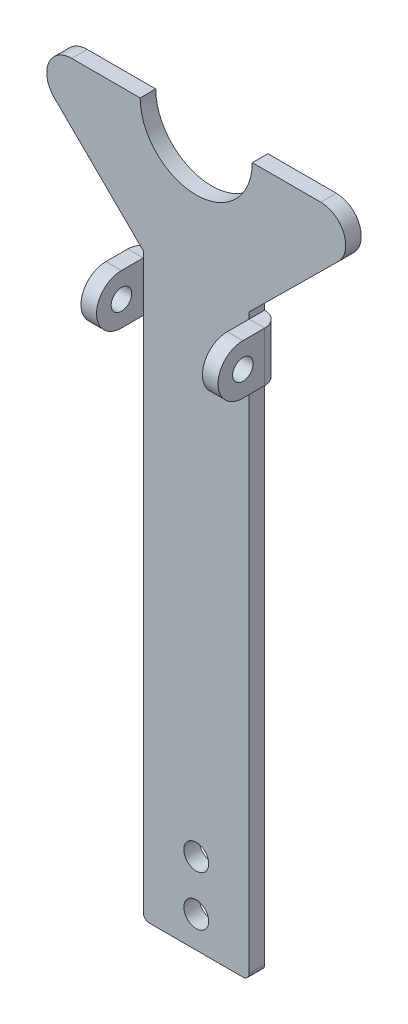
ISO-10303-21;
HEADER;
FILE_DESCRIPTION(('STEP AP214'),'2;1');
FILE_NAME('part.step','',(''),(''),'','','');
FILE_SCHEMA(('AUTOMOTIVE_DESIGN { 1 0 10303 214 1 1 1 1 }'));
ENDSEC;
DATA;
#1=APPLICATION_CONTEXT('core data for automotive mechanical design processes');
#2=APPLICATION_PROTOCOL_DEFINITION('international standard','automotive_design',2000,#1);
#3=PRODUCT_CONTEXT('',#1,'mechanical');
#4=PRODUCT('Part','Part','',(#3));
#5=PRODUCT_RELATED_PRODUCT_CATEGORY('part','',(#4));
#6=PRODUCT_DEFINITION_FORMATION('','',#4);
#7=PRODUCT_DEFINITION_CONTEXT('part definition',#1,'design');
#8=PRODUCT_DEFINITION('design','',#6,#7);
#9=PRODUCT_DEFINITION_SHAPE('','',#8);
#10=(LENGTH_UNIT() NAMED_UNIT(*) SI_UNIT(.MILLI.,.METRE.));
#11=(NAMED_UNIT(*) PLANE_ANGLE_UNIT() SI_UNIT($,.RADIAN.));
#12=(NAMED_UNIT(*) SI_UNIT($,.STERADIAN.) SOLID_ANGLE_UNIT());
#13=UNCERTAINTY_MEASURE_WITH_UNIT(LENGTH_MEASURE(1.E-05),#10,'distance_accuracy_value','');
#14=(GEOMETRIC_REPRESENTATION_CONTEXT(3) GLOBAL_UNCERTAINTY_ASSIGNED_CONTEXT((#13)) GLOBAL_UNIT_ASSIGNED_CONTEXT((#10,
#11,#12)) REPRESENTATION_CONTEXT('',''));
#15=CARTESIAN_POINT('',(0.,0.,0.));
#16=DIRECTION('',(0.,0.,1.));
#17=DIRECTION('',(1.,0.,0.));
#18=AXIS2_PLACEMENT_3D('',#15,#16,#17);
#19=CARTESIAN_POINT('',(8.5,0.,2.5));
#20=DIRECTION('',(-1.,0.,0.));
#21=DIRECTION('',(0.,0.,1.));
#22=AXIS2_PLACEMENT_3D('',#19,#20,#21);
#23=PLANE('',#22);
#24=DIRECTION('',(0.,0.,1.));
#25=VECTOR('',#24,1.);
#26=CARTESIAN_POINT('',(8.49999999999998,91.9999999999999,0.));
#27=LINE('',#26,#25);
#28=CARTESIAN_POINT('',(8.49999999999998,91.9999999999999,0.));
#29=VERTEX_POINT('',#28);
#30=CARTESIAN_POINT('',(8.49999999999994,91.9999999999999,2.5));
#31=VERTEX_POINT('',#30);
#32=EDGE_CURVE('E368',#29,#31,#27,.T.);
#33=ORIENTED_EDGE('',*,*,#32,.F.);
#34=DIRECTION('',(0.,1.,0.));
#35=VECTOR('',#34,1.);
#36=CARTESIAN_POINT('',(8.5,0.,0.));
#37=LINE('',#36,#35);
#38=CARTESIAN_POINT('',(8.5,93.,0.));
#39=VERTEX_POINT('',#38);
#40=EDGE_CURVE('E313',#29,#39,#37,.T.);
#41=ORIENTED_EDGE('',*,*,#40,.T.);
#42=DIRECTION('',(0.,0.,-1.));
#43=VECTOR('',#42,1.);
#44=CARTESIAN_POINT('',(8.5,93.,2.5));
#45=LINE('',#44,#43);
#46=CARTESIAN_POINT('',(8.5,93.,2.5));
#47=VERTEX_POINT('',#46);
#48=EDGE_CURVE('E591',#47,#39,#45,.T.);
#49=ORIENTED_EDGE('',*,*,#48,.F.);
#50=DIRECTION('',(0.,1.,0.));
#51=VECTOR('',#50,1.);
#52=CARTESIAN_POINT('',(8.5,0.,2.5));
#53=LINE('',#52,#51);
#54=EDGE_CURVE('E329',#31,#47,#53,.T.);
#55=ORIENTED_EDGE('',*,*,#54,.F.);
#56=EDGE_LOOP('',(#33,#41,#49,#55));
#57=FACE_BOUND('',#56,.T.);
#58=ADVANCED_FACE('F41',(#57),#23,.F.);
#59=CARTESIAN_POINT('',(-8.5,0.,2.5));
#60=DIRECTION('',(1.,0.,0.));
#61=DIRECTION('',(0.,0.,-1.));
#62=AXIS2_PLACEMENT_3D('',#59,#60,#61);
#63=PLANE('',#62);
#64=DIRECTION('',(0.,-1.,0.));
#65=VECTOR('',#64,1.);
#66=CARTESIAN_POINT('',(-8.5,0.,0.));
#67=LINE('',#66,#65);
#68=CARTESIAN_POINT('',(-8.49999999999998,84.,0.));
#69=VERTEX_POINT('',#68);
#70=CARTESIAN_POINT('',(-8.5,0.999999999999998,0.));
#71=VERTEX_POINT('',#70);
#72=EDGE_CURVE('E300',#69,#71,#67,.T.);
#73=ORIENTED_EDGE('',*,*,#72,.T.);
#74=DIRECTION('',(0.,0.,-1.));
#75=VECTOR('',#74,1.);
#76=CARTESIAN_POINT('',(-8.5,0.999999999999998,2.5));
#77=LINE('',#76,#75);
#78=CARTESIAN_POINT('',(-8.5,0.999999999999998,2.5));
#79=VERTEX_POINT('',#78);
#80=EDGE_CURVE('E11',#71,#79,#77,.F.);
#81=ORIENTED_EDGE('',*,*,#80,.T.);
#82=DIRECTION('',(0.,-1.,0.));
#83=VECTOR('',#82,1.);
#84=CARTESIAN_POINT('',(-8.5,0.,2.5));
#85=LINE('',#84,#83);
#86=CARTESIAN_POINT('',(-8.5,84.,2.5));
#87=VERTEX_POINT('',#86);
#88=EDGE_CURVE('E288',#87,#79,#85,.T.);
#89=ORIENTED_EDGE('',*,*,#88,.F.);
#90=DIRECTION('',(0.,0.,1.));
#91=VECTOR('',#90,1.);
#92=CARTESIAN_POINT('',(-8.49999999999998,84.,0.));
#93=LINE('',#92,#91);
#94=EDGE_CURVE('E347',#69,#87,#93,.T.);
#95=ORIENTED_EDGE('',*,*,#94,.F.);
#96=EDGE_LOOP('',(#73,#81,#89,#95));
#97=FACE_BOUND('',#96,.T.);
#98=ADVANCED_FACE('F435',(#97),#63,.F.);
#99=CARTESIAN_POINT('',(0.,114.,2.5));
#100=DIRECTION('',(0.,0.,-1.));
#101=DIRECTION('',(-1.,0.,0.));
#102=AXIS2_PLACEMENT_3D('',#99,#100,#101);
#103=CYLINDRICAL_SURFACE('',#102,9.);
#104=CARTESIAN_POINT('',(0.,114.,0.));
#105=DIRECTION('',(0.,0.,-1.));
#106=DIRECTION('',(1.,0.,0.));
#107=AXIS2_PLACEMENT_3D('',#104,#105,#106);
#108=CIRCLE('',#107,9.);
#109=CARTESIAN_POINT('',(9.,114.,0.));
#110=VERTEX_POINT('',#109);
#111=CARTESIAN_POINT('',(-9.,114.,0.));
#112=VERTEX_POINT('',#111);
#113=EDGE_CURVE('E277',#110,#112,#108,.T.);
#114=ORIENTED_EDGE('',*,*,#113,.T.);
#115=DIRECTION('',(0.,0.,-1.));
#116=VECTOR('',#115,1.);
#117=CARTESIAN_POINT('',(-9.,114.,2.5));
#118=LINE('',#117,#116);
#119=CARTESIAN_POINT('',(-9.,114.,2.5));
#120=VERTEX_POINT('',#119);
#121=EDGE_CURVE('E341',#120,#112,#118,.T.);
#122=ORIENTED_EDGE('',*,*,#121,.F.);
#123=CARTESIAN_POINT('',(0.,114.,2.5));
#124=DIRECTION('',(0.,0.,-1.));
#125=DIRECTION('',(1.,0.,0.));
#126=AXIS2_PLACEMENT_3D('',#123,#124,#125);
#127=CIRCLE('',#126,9.);
#128=CARTESIAN_POINT('',(9.,114.,2.5));
#129=VERTEX_POINT('',#128);
#130=EDGE_CURVE('E278',#129,#120,#127,.T.);
#131=ORIENTED_EDGE('',*,*,#130,.F.);
#132=DIRECTION('',(0.,0.,-1.));
#133=VECTOR('',#132,1.);
#134=CARTESIAN_POINT('',(9.,114.,2.5));
#135=LINE('',#134,#133);
#136=EDGE_CURVE('E583',#129,#110,#135,.T.);
#137=ORIENTED_EDGE('',*,*,#136,.T.);
#138=EDGE_LOOP('',(#114,#122,#131,#137));
#139=FACE_BOUND('',#138,.T.);
#140=ADVANCED_FACE('F441',(#139),#103,.F.);
#141=CARTESIAN_POINT('',(-20.,114.,2.5));
#142=DIRECTION('',(0.,-1.,0.));
#143=DIRECTION('',(0.,0.,-1.));
#144=AXIS2_PLACEMENT_3D('',#141,#142,#143);
#145=PLANE('',#144);
#146=DIRECTION('',(-1.,0.,0.));
#147=VECTOR('',#146,1.);
#148=CARTESIAN_POINT('',(-20.,114.,0.));
#149=LINE('',#148,#147);
#150=CARTESIAN_POINT('',(-20.,114.,0.));
#151=VERTEX_POINT('',#150);
#152=EDGE_CURVE('E605',#112,#151,#149,.T.);
#153=ORIENTED_EDGE('',*,*,#152,.T.);
#154=DIRECTION('',(0.,0.,-1.));
#155=VECTOR('',#154,1.);
#156=CARTESIAN_POINT('',(-20.,114.,2.5));
#157=LINE('',#156,#155);
#158=CARTESIAN_POINT('',(-20.,114.,2.5));
#159=VERTEX_POINT('',#158);
#160=EDGE_CURVE('E600',#159,#151,#157,.T.);
#161=ORIENTED_EDGE('',*,*,#160,.F.);
#162=DIRECTION('',(-1.,0.,0.));
#163=VECTOR('',#162,1.);
#164=CARTESIAN_POINT('',(-20.,114.,2.5));
#165=LINE('',#164,#163);
#166=EDGE_CURVE('E281',#120,#159,#165,.T.);
#167=ORIENTED_EDGE('',*,*,#166,.F.);
#168=ORIENTED_EDGE('',*,*,#121,.T.);
#169=EDGE_LOOP('',(#153,#161,#167,#168));
#170=FACE_BOUND('',#169,.T.);
#171=ADVANCED_FACE('F468',(#170),#145,.F.);
#172=CARTESIAN_POINT('',(-20.,110.,2.5));
#173=DIRECTION('',(0.,0.,-1.));
#174=DIRECTION('',(-1.,0.,0.));
#175=AXIS2_PLACEMENT_3D('',#172,#173,#174);
#176=CYLINDRICAL_SURFACE('',#175,3.99999999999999);
#177=CARTESIAN_POINT('',(-20.,110.,0.));
#178=DIRECTION('',(0.,0.,1.));
#179=DIRECTION('',(-1.,0.,0.));
#180=AXIS2_PLACEMENT_3D('',#177,#178,#179);
#181=CIRCLE('',#180,3.99999999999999);
#182=CARTESIAN_POINT('',(-22.8128092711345,107.156040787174,0.));
#183=VERTEX_POINT('',#182);
#184=EDGE_CURVE('E608',#151,#183,#181,.T.);
#185=ORIENTED_EDGE('',*,*,#184,.T.);
#186=DIRECTION('',(0.,0.,-1.));
#187=VECTOR('',#186,1.);
#188=CARTESIAN_POINT('',(-22.8128092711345,107.156040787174,2.5));
#189=LINE('',#188,#187);
#190=CARTESIAN_POINT('',(-22.8128092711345,107.156040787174,2.5));
#191=VERTEX_POINT('',#190);
#192=EDGE_CURVE('E597',#191,#183,#189,.T.);
#193=ORIENTED_EDGE('',*,*,#192,.F.);
#194=CARTESIAN_POINT('',(-20.,110.,2.5));
#195=DIRECTION('',(0.,0.,1.));
#196=DIRECTION('',(-1.,0.,0.));
#197=AXIS2_PLACEMENT_3D('',#194,#195,#196);
#198=CIRCLE('',#197,3.99999999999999);
#199=EDGE_CURVE('E284',#159,#191,#198,.T.);
#200=ORIENTED_EDGE('',*,*,#199,.F.);
#201=ORIENTED_EDGE('',*,*,#160,.T.);
#202=EDGE_LOOP('',(#185,#193,#200,#201));
#203=FACE_BOUND('',#202,.T.);
#204=ADVANCED_FACE('F464',(#203),#176,.T.);
#205=CARTESIAN_POINT('',(-8.5,93.,2.5));
#206=DIRECTION('',(0.703202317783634,0.710989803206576,0.));
#207=DIRECTION('',(-0.710989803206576,0.703202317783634,0.));
#208=AXIS2_PLACEMENT_3D('',#205,#206,#207);
#209=PLANE('',#208);
#210=DIRECTION('',(0.710989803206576,-0.703202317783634,0.));
#211=VECTOR('',#210,1.);
#212=CARTESIAN_POINT('',(-8.5,93.,0.));
#213=LINE('',#212,#211);
#214=CARTESIAN_POINT('',(-8.5,93.,0.));
#215=VERTEX_POINT('',#214);
#216=EDGE_CURVE('E304',#183,#215,#213,.T.);
#217=ORIENTED_EDGE('',*,*,#216,.T.);
#218=DIRECTION('',(0.,0.,-1.));
#219=VECTOR('',#218,1.);
#220=CARTESIAN_POINT('',(-8.5,93.,2.5));
#221=LINE('',#220,#219);
#222=CARTESIAN_POINT('',(-8.5,93.,2.5));
#223=VERTEX_POINT('',#222);
#224=EDGE_CURVE('E594',#223,#215,#221,.T.);
#225=ORIENTED_EDGE('',*,*,#224,.F.);
#226=DIRECTION('',(0.710989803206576,-0.703202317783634,0.));
#227=VECTOR('',#226,1.);
#228=CARTESIAN_POINT('',(-8.5,93.,2.5));
#229=LINE('',#228,#227);
#230=EDGE_CURVE('E286',#191,#223,#229,.T.);
#231=ORIENTED_EDGE('',*,*,#230,.F.);
#232=ORIENTED_EDGE('',*,*,#192,.T.);
#233=EDGE_LOOP('',(#217,#225,#231,#232));
#234=FACE_BOUND('',#233,.T.);
#235=ADVANCED_FACE('F459',(#234),#209,.F.);
#236=CARTESIAN_POINT('',(-8.49999999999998,92.,0.));
#237=VERTEX_POINT('',#236);
#238=EDGE_CURVE('E303',#215,#237,#67,.T.);
#239=ORIENTED_EDGE('',*,*,#238,.T.);
#240=DIRECTION('',(0.,0.,1.));
#241=VECTOR('',#240,1.);
#242=CARTESIAN_POINT('',(-8.49999999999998,92.,0.));
#243=LINE('',#242,#241);
#244=CARTESIAN_POINT('',(-8.5,92.,2.5));
#245=VERTEX_POINT('',#244);
#246=EDGE_CURVE('E340',#237,#245,#243,.T.);
#247=ORIENTED_EDGE('',*,*,#246,.T.);
#248=EDGE_CURVE('E297',#223,#245,#85,.T.);
#249=ORIENTED_EDGE('',*,*,#248,.F.);
#250=ORIENTED_EDGE('',*,*,#224,.T.);
#251=EDGE_LOOP('',(#239,#247,#249,#250));
#252=FACE_BOUND('',#251,.T.);
#253=ADVANCED_FACE('F443',(#252),#63,.F.);
#254=CARTESIAN_POINT('',(8.5,0.,2.5));
#255=DIRECTION('',(0.,1.,0.));
#256=DIRECTION('',(0.,0.,1.));
#257=AXIS2_PLACEMENT_3D('',#254,#255,#256);
#258=PLANE('',#257);
#259=DIRECTION('',(1.,0.,0.));
#260=VECTOR('',#259,1.);
#261=CARTESIAN_POINT('',(8.5,0.,0.));
#262=LINE('',#261,#260);
#263=CARTESIAN_POINT('',(-7.5,0.,0.));
#264=VERTEX_POINT('',#263);
#265=CARTESIAN_POINT('',(7.5,0.,0.));
#266=VERTEX_POINT('',#265);
#267=EDGE_CURVE('E310',#264,#266,#262,.T.);
#268=ORIENTED_EDGE('',*,*,#267,.T.);
#269=DIRECTION('',(0.,0.,-1.));
#270=VECTOR('',#269,1.);
#271=CARTESIAN_POINT('',(7.5,0.,2.5));
#272=LINE('',#271,#270);
#273=CARTESIAN_POINT('',(7.5,0.,2.5));
#274=VERTEX_POINT('',#273);
#275=EDGE_CURVE('E64',#266,#274,#272,.F.);
#276=ORIENTED_EDGE('',*,*,#275,.T.);
#277=DIRECTION('',(1.,0.,0.));
#278=VECTOR('',#277,1.);
#279=CARTESIAN_POINT('',(8.5,0.,2.5));
#280=LINE('',#279,#278);
#281=CARTESIAN_POINT('',(-7.5,0.,2.5));
#282=VERTEX_POINT('',#281);
#283=EDGE_CURVE('E291',#282,#274,#280,.T.);
#284=ORIENTED_EDGE('',*,*,#283,.F.);
#285=DIRECTION('',(0.,0.,-1.));
#286=VECTOR('',#285,1.);
#287=CARTESIAN_POINT('',(-7.5,0.,2.5));
#288=LINE('',#287,#286);
#289=EDGE_CURVE('E643',#282,#264,#288,.T.);
#290=ORIENTED_EDGE('',*,*,#289,.T.);
#291=EDGE_LOOP('',(#268,#276,#284,#290));
#292=FACE_BOUND('',#291,.T.);
#293=ADVANCED_FACE('F449',(#292),#258,.F.);
#294=CARTESIAN_POINT('',(8.5,0.999999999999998,2.5));
#295=VERTEX_POINT('',#294);
#296=CARTESIAN_POINT('',(8.5,83.9999999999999,2.5));
#297=VERTEX_POINT('',#296);
#298=EDGE_CURVE('E326',#295,#297,#53,.T.);
#299=ORIENTED_EDGE('',*,*,#298,.F.);
#300=DIRECTION('',(0.,0.,-1.));
#301=VECTOR('',#300,1.);
#302=CARTESIAN_POINT('',(8.5,0.999999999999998,2.5));
#303=LINE('',#302,#301);
#304=CARTESIAN_POINT('',(8.5,0.999999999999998,0.));
#305=VERTEX_POINT('',#304);
#306=EDGE_CURVE('E330',#295,#305,#303,.T.);
#307=ORIENTED_EDGE('',*,*,#306,.T.);
#308=CARTESIAN_POINT('',(8.49999999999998,84.,0.));
#309=VERTEX_POINT('',#308);
#310=EDGE_CURVE('E321',#305,#309,#37,.T.);
#311=ORIENTED_EDGE('',*,*,#310,.T.);
#312=DIRECTION('',(0.,0.,1.));
#313=VECTOR('',#312,1.);
#314=CARTESIAN_POINT('',(8.49999999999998,84.,0.));
#315=LINE('',#314,#313);
#316=EDGE_CURVE('E362',#309,#297,#315,.T.);
#317=ORIENTED_EDGE('',*,*,#316,.T.);
#318=EDGE_LOOP('',(#299,#307,#311,#317));
#319=FACE_BOUND('',#318,.T.);
#320=ADVANCED_FACE('F379',(#319),#23,.F.);
#321=CARTESIAN_POINT('',(8.5,93.,2.5));
#322=DIRECTION('',(-0.703202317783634,0.710989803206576,0.));
#323=DIRECTION('',(-0.710989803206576,-0.703202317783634,0.));
#324=AXIS2_PLACEMENT_3D('',#321,#322,#323);
#325=PLANE('',#324);
#326=DIRECTION('',(0.710989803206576,0.703202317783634,0.));
#327=VECTOR('',#326,1.);
#328=CARTESIAN_POINT('',(8.5,93.,0.));
#329=LINE('',#328,#327);
#330=CARTESIAN_POINT('',(22.8128092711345,107.156040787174,0.));
#331=VERTEX_POINT('',#330);
#332=EDGE_CURVE('E316',#39,#331,#329,.T.);
#333=ORIENTED_EDGE('',*,*,#332,.T.);
#334=DIRECTION('',(0.,0.,-1.));
#335=VECTOR('',#334,1.);
#336=CARTESIAN_POINT('',(22.8128092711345,107.156040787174,2.5));
#337=LINE('',#336,#335);
#338=CARTESIAN_POINT('',(22.8128092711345,107.156040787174,2.5));
#339=VERTEX_POINT('',#338);
#340=EDGE_CURVE('E578',#339,#331,#337,.T.);
#341=ORIENTED_EDGE('',*,*,#340,.F.);
#342=DIRECTION('',(0.710989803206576,0.703202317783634,0.));
#343=VECTOR('',#342,1.);
#344=CARTESIAN_POINT('',(8.5,93.,2.5));
#345=LINE('',#344,#343);
#346=EDGE_CURVE('E328',#47,#339,#345,.T.);
#347=ORIENTED_EDGE('',*,*,#346,.F.);
#348=ORIENTED_EDGE('',*,*,#48,.T.);
#349=EDGE_LOOP('',(#333,#341,#347,#348));
#350=FACE_BOUND('',#349,.T.);
#351=ADVANCED_FACE('F448',(#350),#325,.F.);
#352=CARTESIAN_POINT('',(20.,110.,2.5));
#353=DIRECTION('',(0.,0.,-1.));
#354=DIRECTION('',(-1.,0.,0.));
#355=AXIS2_PLACEMENT_3D('',#352,#353,#354);
#356=CYLINDRICAL_SURFACE('',#355,3.99999999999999);
#357=CARTESIAN_POINT('',(20.,110.,0.));
#358=DIRECTION('',(0.,0.,1.));
#359=DIRECTION('',(1.,0.,0.));
#360=AXIS2_PLACEMENT_3D('',#357,#358,#359);
#361=CIRCLE('',#360,3.99999999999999);
#362=CARTESIAN_POINT('',(20.,114.,0.));
#363=VERTEX_POINT('',#362);
#364=EDGE_CURVE('E572',#331,#363,#361,.T.);
#365=ORIENTED_EDGE('',*,*,#364,.T.);
#366=DIRECTION('',(0.,0.,-1.));
#367=VECTOR('',#366,1.);
#368=CARTESIAN_POINT('',(20.,114.,2.5));
#369=LINE('',#368,#367);
#370=CARTESIAN_POINT('',(20.,114.,2.5));
#371=VERTEX_POINT('',#370);
#372=EDGE_CURVE('E575',#371,#363,#369,.T.);
#373=ORIENTED_EDGE('',*,*,#372,.F.);
#374=CARTESIAN_POINT('',(20.,110.,2.5));
#375=DIRECTION('',(0.,0.,1.));
#376=DIRECTION('',(1.,0.,0.));
#377=AXIS2_PLACEMENT_3D('',#374,#375,#376);
#378=CIRCLE('',#377,3.99999999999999);
#379=EDGE_CURVE('E631',#339,#371,#378,.T.);
#380=ORIENTED_EDGE('',*,*,#379,.F.);
#381=ORIENTED_EDGE('',*,*,#340,.T.);
#382=EDGE_LOOP('',(#365,#373,#380,#381));
#383=FACE_BOUND('',#382,.T.);
#384=ADVANCED_FACE('F454',(#383),#356,.T.);
#385=CARTESIAN_POINT('',(20.,114.,2.5));
#386=DIRECTION('',(0.,-1.,0.));
#387=DIRECTION('',(0.,0.,-1.));
#388=AXIS2_PLACEMENT_3D('',#385,#386,#387);
#389=PLANE('',#388);
#390=DIRECTION('',(-1.,0.,0.));
#391=VECTOR('',#390,1.);
#392=CARTESIAN_POINT('',(20.,114.,0.));
#393=LINE('',#392,#391);
#394=EDGE_CURVE('E282',#363,#110,#393,.T.);
#395=ORIENTED_EDGE('',*,*,#394,.T.);
#396=ORIENTED_EDGE('',*,*,#136,.F.);
#397=DIRECTION('',(-1.,0.,0.));
#398=VECTOR('',#397,1.);
#399=CARTESIAN_POINT('',(20.,114.,2.5));
#400=LINE('',#399,#398);
#401=EDGE_CURVE('E582',#371,#129,#400,.T.);
#402=ORIENTED_EDGE('',*,*,#401,.F.);
#403=ORIENTED_EDGE('',*,*,#372,.T.);
#404=EDGE_LOOP('',(#395,#396,#402,#403));
#405=FACE_BOUND('',#404,.T.);
#406=ADVANCED_FACE('F559',(#405),#389,.F.);
#407=CARTESIAN_POINT('',(0.,114.,2.5));
#408=DIRECTION('',(0.,0.,1.));
#409=DIRECTION('',(1.,0.,0.));
#410=AXIS2_PLACEMENT_3D('',#407,#408,#409);
#411=PLANE('',#410);
#412=CARTESIAN_POINT('',(0.,13.,2.5));
#413=DIRECTION('',(0.,0.,1.));
#414=DIRECTION('',(1.,0.,0.));
#415=AXIS2_PLACEMENT_3D('',#412,#413,#414);
#416=CIRCLE('',#415,2.);
#417=CARTESIAN_POINT('',(2.,13.,2.5));
#418=VERTEX_POINT('',#417);
#419=EDGE_CURVE('E415',#418,#418,#416,.T.);
#420=ORIENTED_EDGE('',*,*,#419,.F.);
#421=EDGE_LOOP('',(#420));
#422=FACE_BOUND('',#421,.T.);
#423=CARTESIAN_POINT('',(0.,5.,2.5));
#424=DIRECTION('',(0.,0.,1.));
#425=DIRECTION('',(1.,0.,0.));
#426=AXIS2_PLACEMENT_3D('',#423,#424,#425);
#427=CIRCLE('',#426,2.);
#428=CARTESIAN_POINT('',(2.,5.,2.5));
#429=VERTEX_POINT('',#428);
#430=EDGE_CURVE('E412',#429,#429,#427,.T.);
#431=ORIENTED_EDGE('',*,*,#430,.F.);
#432=EDGE_LOOP('',(#431));
#433=FACE_BOUND('',#432,.T.);
#434=ORIENTED_EDGE('',*,*,#283,.T.);
#435=CARTESIAN_POINT('',(7.5,0.999999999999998,2.5));
#436=DIRECTION('',(0.,0.,1.));
#437=DIRECTION('',(1.,0.,0.));
#438=AXIS2_PLACEMENT_3D('',#435,#436,#437);
#439=CIRCLE('',#438,1.);
#440=EDGE_CURVE('E50',#274,#295,#439,.T.);
#441=ORIENTED_EDGE('',*,*,#440,.T.);
#442=ORIENTED_EDGE('',*,*,#298,.T.);
#443=DIRECTION('',(0.,1.,0.));
#444=VECTOR('',#443,1.);
#445=CARTESIAN_POINT('',(8.5,84.,2.49999999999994));
#446=LINE('',#445,#444);
#447=EDGE_CURVE('E350',#297,#31,#446,.T.);
#448=ORIENTED_EDGE('',*,*,#447,.T.);
#449=ORIENTED_EDGE('',*,*,#54,.T.);
#450=ORIENTED_EDGE('',*,*,#346,.T.);
#451=ORIENTED_EDGE('',*,*,#379,.T.);
#452=ORIENTED_EDGE('',*,*,#401,.T.);
#453=ORIENTED_EDGE('',*,*,#130,.T.);
#454=ORIENTED_EDGE('',*,*,#166,.T.);
#455=ORIENTED_EDGE('',*,*,#199,.T.);
#456=ORIENTED_EDGE('',*,*,#230,.T.);
#457=ORIENTED_EDGE('',*,*,#248,.T.);
#458=DIRECTION('',(0.,-1.,0.));
#459=VECTOR('',#458,1.);
#460=CARTESIAN_POINT('',(-8.5,92.,2.5));
#461=LINE('',#460,#459);
#462=EDGE_CURVE('E337',#245,#87,#461,.T.);
#463=ORIENTED_EDGE('',*,*,#462,.T.);
#464=ORIENTED_EDGE('',*,*,#88,.T.);
#465=CARTESIAN_POINT('',(-7.5,0.999999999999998,2.5));
#466=DIRECTION('',(0.,0.,1.));
#467=DIRECTION('',(1.,0.,0.));
#468=AXIS2_PLACEMENT_3D('',#465,#466,#467);
#469=CIRCLE('',#468,1.);
#470=EDGE_CURVE('E487',#79,#282,#469,.T.);
#471=ORIENTED_EDGE('',*,*,#470,.T.);
#472=EDGE_LOOP('',(#434,#441,#442,#448,#449,#450,#451,#452,#453,#454,#455,#456,#457,#463,#464,#471));
#473=FACE_BOUND('',#472,.T.);
#474=ADVANCED_FACE('F497',(#422,#433,#473),#411,.T.);
#475=CARTESIAN_POINT('',(0.,114.,0.));
#476=DIRECTION('',(0.,0.,1.));
#477=DIRECTION('',(1.,0.,0.));
#478=AXIS2_PLACEMENT_3D('',#475,#476,#477);
#479=PLANE('',#478);
#480=CARTESIAN_POINT('',(0.,13.,0.));
#481=DIRECTION('',(0.,0.,1.));
#482=DIRECTION('',(1.,0.,0.));
#483=AXIS2_PLACEMENT_3D('',#480,#481,#482);
#484=CIRCLE('',#483,2.);
#485=CARTESIAN_POINT('',(2.,13.,0.));
#486=VERTEX_POINT('',#485);
#487=EDGE_CURVE('E45',#486,#486,#484,.T.);
#488=ORIENTED_EDGE('',*,*,#487,.T.);
#489=EDGE_LOOP('',(#488));
#490=FACE_BOUND('',#489,.T.);
#491=CARTESIAN_POINT('',(0.,5.,0.));
#492=DIRECTION('',(0.,0.,1.));
#493=DIRECTION('',(1.,0.,0.));
#494=AXIS2_PLACEMENT_3D('',#491,#492,#493);
#495=CIRCLE('',#494,2.);
#496=CARTESIAN_POINT('',(2.,5.,0.));
#497=VERTEX_POINT('',#496);
#498=EDGE_CURVE('E221',#497,#497,#495,.T.);
#499=ORIENTED_EDGE('',*,*,#498,.T.);
#500=EDGE_LOOP('',(#499));
#501=FACE_BOUND('',#500,.T.);
#502=ORIENTED_EDGE('',*,*,#310,.F.);
#503=CARTESIAN_POINT('',(7.5,0.999999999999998,0.));
#504=DIRECTION('',(0.,0.,1.));
#505=DIRECTION('',(1.,0.,0.));
#506=AXIS2_PLACEMENT_3D('',#503,#504,#505);
#507=CIRCLE('',#506,1.);
#508=EDGE_CURVE('E500',#305,#266,#507,.F.);
#509=ORIENTED_EDGE('',*,*,#508,.T.);
#510=ORIENTED_EDGE('',*,*,#267,.F.);
#511=CARTESIAN_POINT('',(-7.5,0.999999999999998,0.));
#512=DIRECTION('',(0.,0.,1.));
#513=DIRECTION('',(1.,0.,0.));
#514=AXIS2_PLACEMENT_3D('',#511,#512,#513);
#515=CIRCLE('',#514,1.);
#516=EDGE_CURVE('E641',#264,#71,#515,.F.);
#517=ORIENTED_EDGE('',*,*,#516,.T.);
#518=ORIENTED_EDGE('',*,*,#72,.F.);
#519=DIRECTION('',(0.,-1.,0.));
#520=VECTOR('',#519,1.);
#521=CARTESIAN_POINT('',(-8.49999999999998,92.,0.));
#522=LINE('',#521,#520);
#523=EDGE_CURVE('E344',#237,#69,#522,.T.);
#524=ORIENTED_EDGE('',*,*,#523,.F.);
#525=ORIENTED_EDGE('',*,*,#238,.F.);
#526=ORIENTED_EDGE('',*,*,#216,.F.);
#527=ORIENTED_EDGE('',*,*,#184,.F.);
#528=ORIENTED_EDGE('',*,*,#152,.F.);
#529=ORIENTED_EDGE('',*,*,#113,.F.);
#530=ORIENTED_EDGE('',*,*,#394,.F.);
#531=ORIENTED_EDGE('',*,*,#364,.F.);
#532=ORIENTED_EDGE('',*,*,#332,.F.);
#533=ORIENTED_EDGE('',*,*,#40,.F.);
#534=DIRECTION('',(0.,1.,0.));
#535=VECTOR('',#534,1.);
#536=CARTESIAN_POINT('',(8.49999999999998,84.,0.));
#537=LINE('',#536,#535);
#538=EDGE_CURVE('E365',#309,#29,#537,.T.);
#539=ORIENTED_EDGE('',*,*,#538,.F.);
#540=EDGE_LOOP('',(#502,#509,#510,#517,#518,#524,#525,#526,#527,#528,#529,#530,#531,#532,#533,#539));
#541=FACE_BOUND('',#540,.T.);
#542=ADVANCED_FACE('F422',(#490,#501,#541),#479,.F.);
#543=CARTESIAN_POINT('',(-11.,92.,2.50000000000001));
#544=DIRECTION('',(0.,1.,0.));
#545=DIRECTION('',(0.,0.,1.));
#546=AXIS2_PLACEMENT_3D('',#543,#544,#545);
#547=PLANE('',#546);
#548=CARTESIAN_POINT('',(-8.5,92.,2.5));
#549=DIRECTION('',(0.,-1.,0.));
#550=DIRECTION('',(0.,0.,-1.));
#551=AXIS2_PLACEMENT_3D('',#548,#549,#550);
#552=CIRCLE('',#551,2.5);
#553=CARTESIAN_POINT('',(-11.,92.,2.49999999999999));
#554=VERTEX_POINT('',#553);
#555=EDGE_CURVE('E274',#554,#237,#552,.T.);
#556=ORIENTED_EDGE('',*,*,#555,.F.);
#557=DIRECTION('',(1.,0.,0.));
#558=VECTOR('',#557,1.);
#559=CARTESIAN_POINT('',(-11.,92.,2.49999999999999));
#560=LINE('',#559,#558);
#561=EDGE_CURVE('E233',#554,#245,#560,.T.);
#562=ORIENTED_EDGE('',*,*,#561,.T.);
#563=ORIENTED_EDGE('',*,*,#246,.F.);
#564=EDGE_LOOP('',(#556,#562,#563));
#565=FACE_BOUND('',#564,.T.);
#566=ADVANCED_FACE('F496',(#565),#547,.T.);
#567=CARTESIAN_POINT('',(-8.5,84.,2.5));
#568=DIRECTION('',(0.,-1.,0.));
#569=DIRECTION('',(0.,0.,-1.));
#570=AXIS2_PLACEMENT_3D('',#567,#568,#569);
#571=CYLINDRICAL_SURFACE('',#570,2.5);
#572=CARTESIAN_POINT('',(-8.5,84.,2.5));
#573=DIRECTION('',(0.,-1.,0.));
#574=DIRECTION('',(0.,0.,-1.));
#575=AXIS2_PLACEMENT_3D('',#572,#573,#574);
#576=CIRCLE('',#575,2.5);
#577=CARTESIAN_POINT('',(-11.,84.,2.49999999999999));
#578=VERTEX_POINT('',#577);
#579=EDGE_CURVE('E271',#578,#69,#576,.T.);
#580=ORIENTED_EDGE('',*,*,#579,.F.);
#581=DIRECTION('',(0.,-1.,0.));
#582=VECTOR('',#581,1.);
#583=CARTESIAN_POINT('',(-11.,92.,2.49999999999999));
#584=LINE('',#583,#582);
#585=EDGE_CURVE('E243',#554,#578,#584,.T.);
#586=ORIENTED_EDGE('',*,*,#585,.F.);
#587=ORIENTED_EDGE('',*,*,#555,.T.);
#588=ORIENTED_EDGE('',*,*,#523,.T.);
#589=EDGE_LOOP('',(#580,#586,#587,#588));
#590=FACE_BOUND('',#589,.T.);
#591=ADVANCED_FACE('F550',(#590),#571,.T.);
#592=CARTESIAN_POINT('',(-11.,84.,2.50000000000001));
#593=DIRECTION('',(0.,1.,0.));
#594=DIRECTION('',(0.,0.,1.));
#595=AXIS2_PLACEMENT_3D('',#592,#593,#594);
#596=PLANE('',#595);
#597=DIRECTION('',(1.,0.,0.));
#598=VECTOR('',#597,1.);
#599=CARTESIAN_POINT('',(-11.,84.,2.49999999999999));
#600=LINE('',#599,#598);
#601=EDGE_CURVE('E236',#578,#87,#600,.T.);
#602=ORIENTED_EDGE('',*,*,#601,.F.);
#603=ORIENTED_EDGE('',*,*,#579,.T.);
#604=ORIENTED_EDGE('',*,*,#94,.T.);
#605=EDGE_LOOP('',(#602,#603,#604));
#606=FACE_BOUND('',#605,.T.);
#607=ADVANCED_FACE('F528',(#606),#596,.F.);
#608=CARTESIAN_POINT('',(-11.,88.,5.99999999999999));
#609=DIRECTION('',(1.,0.,0.));
#610=DIRECTION('',(0.,0.,-1.));
#611=AXIS2_PLACEMENT_3D('',#608,#609,#610);
#612=CYLINDRICAL_SURFACE('',#611,4.);
#613=CARTESIAN_POINT('',(-8.50000000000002,88.,6.));
#614=DIRECTION('',(-1.,0.,0.));
#615=DIRECTION('',(0.,0.,-1.));
#616=AXIS2_PLACEMENT_3D('',#613,#614,#615);
#617=CIRCLE('',#616,4.);
#618=CARTESIAN_POINT('',(-8.50000000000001,84.,6.));
#619=VERTEX_POINT('',#618);
#620=CARTESIAN_POINT('',(-8.50000000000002,92.,6.));
#621=VERTEX_POINT('',#620);
#622=EDGE_CURVE('E265',#619,#621,#617,.T.);
#623=ORIENTED_EDGE('',*,*,#622,.T.);
#624=DIRECTION('',(1.,0.,0.));
#625=VECTOR('',#624,1.);
#626=CARTESIAN_POINT('',(-11.,92.,5.99999999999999));
#627=LINE('',#626,#625);
#628=CARTESIAN_POINT('',(-11.,92.,5.99999999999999));
#629=VERTEX_POINT('',#628);
#630=EDGE_CURVE('E251',#629,#621,#627,.T.);
#631=ORIENTED_EDGE('',*,*,#630,.F.);
#632=CARTESIAN_POINT('',(-11.,88.,5.99999999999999));
#633=DIRECTION('',(-1.,0.,0.));
#634=DIRECTION('',(0.,0.,-1.));
#635=AXIS2_PLACEMENT_3D('',#632,#633,#634);
#636=CIRCLE('',#635,4.);
#637=CARTESIAN_POINT('',(-11.,84.,5.99999999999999));
#638=VERTEX_POINT('',#637);
#639=EDGE_CURVE('E237',#638,#629,#636,.T.);
#640=ORIENTED_EDGE('',*,*,#639,.F.);
#641=DIRECTION('',(1.,0.,0.));
#642=VECTOR('',#641,1.);
#643=CARTESIAN_POINT('',(-11.,84.,5.99999999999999));
#644=LINE('',#643,#642);
#645=EDGE_CURVE('E262',#638,#619,#644,.T.);
#646=ORIENTED_EDGE('',*,*,#645,.T.);
#647=EDGE_LOOP('',(#623,#631,#640,#646));
#648=FACE_BOUND('',#647,.T.);
#649=ADVANCED_FACE('F524',(#648),#612,.T.);
#650=CARTESIAN_POINT('',(-8.49999999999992,88.,5.99999999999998));
#651=DIRECTION('',(1.,0.,0.));
#652=DIRECTION('',(0.,-1.,0.));
#653=AXIS2_PLACEMENT_3D('',#650,#651,#652);
#654=CYLINDRICAL_SURFACE('',#653,1.64999999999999);
#655=CARTESIAN_POINT('',(-8.49999999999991,88.,5.99999999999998));
#656=DIRECTION('',(1.,0.,0.));
#657=DIRECTION('',(0.,-1.,0.));
#658=AXIS2_PLACEMENT_3D('',#655,#656,#657);
#659=CIRCLE('',#658,1.64999999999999);
#660=CARTESIAN_POINT('',(-8.49999999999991,86.35,5.99999999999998));
#661=VERTEX_POINT('',#660);
#662=EDGE_CURVE('E257',#661,#661,#659,.T.);
#663=ORIENTED_EDGE('',*,*,#662,.T.);
#664=EDGE_LOOP('',(#663));
#665=FACE_BOUND('',#664,.T.);
#666=CARTESIAN_POINT('',(-11.,88.,5.99999999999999));
#667=DIRECTION('',(1.,0.,0.));
#668=DIRECTION('',(0.,0.,-1.));
#669=AXIS2_PLACEMENT_3D('',#666,#667,#668);
#670=CIRCLE('',#669,1.64999999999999);
#671=CARTESIAN_POINT('',(-11.,88.,4.35));
#672=VERTEX_POINT('',#671);
#673=EDGE_CURVE('E248',#672,#672,#670,.T.);
#674=ORIENTED_EDGE('',*,*,#673,.F.);
#675=EDGE_LOOP('',(#674));
#676=FACE_BOUND('',#675,.T.);
#677=ADVANCED_FACE('F527',(#665,#676),#654,.F.);
#678=CARTESIAN_POINT('',(-8.50000000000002,88.,6.));
#679=DIRECTION('',(1.,0.,0.));
#680=DIRECTION('',(0.,0.,-1.));
#681=AXIS2_PLACEMENT_3D('',#678,#679,#680);
#682=PLANE('',#681);
#683=ORIENTED_EDGE('',*,*,#662,.F.);
#684=EDGE_LOOP('',(#683));
#685=FACE_BOUND('',#684,.T.);
#686=DIRECTION('',(0.,0.,-1.));
#687=VECTOR('',#686,1.);
#688=CARTESIAN_POINT('',(-8.5,92.,2.5));
#689=LINE('',#688,#687);
#690=EDGE_CURVE('E254',#621,#245,#689,.T.);
#691=ORIENTED_EDGE('',*,*,#690,.F.);
#692=ORIENTED_EDGE('',*,*,#622,.F.);
#693=DIRECTION('',(0.,0.,1.));
#694=VECTOR('',#693,1.);
#695=CARTESIAN_POINT('',(-8.50000000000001,84.,6.));
#696=LINE('',#695,#694);
#697=EDGE_CURVE('E234',#87,#619,#696,.T.);
#698=ORIENTED_EDGE('',*,*,#697,.F.);
#699=ORIENTED_EDGE('',*,*,#462,.F.);
#700=EDGE_LOOP('',(#691,#692,#698,#699));
#701=FACE_BOUND('',#700,.T.);
#702=ADVANCED_FACE('F532',(#685,#701),#682,.T.);
#703=CARTESIAN_POINT('',(-11.,92.,2.49999999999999));
#704=DIRECTION('',(0.,-1.,0.));
#705=DIRECTION('',(0.,0.,-1.));
#706=AXIS2_PLACEMENT_3D('',#703,#704,#705);
#707=PLANE('',#706);
#708=ORIENTED_EDGE('',*,*,#690,.T.);
#709=ORIENTED_EDGE('',*,*,#561,.F.);
#710=DIRECTION('',(0.,0.,-1.));
#711=VECTOR('',#710,1.);
#712=CARTESIAN_POINT('',(-11.,92.,2.49999999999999));
#713=LINE('',#712,#711);
#714=EDGE_CURVE('E246',#629,#554,#713,.T.);
#715=ORIENTED_EDGE('',*,*,#714,.F.);
#716=ORIENTED_EDGE('',*,*,#630,.T.);
#717=EDGE_LOOP('',(#708,#709,#715,#716));
#718=FACE_BOUND('',#717,.T.);
#719=ADVANCED_FACE('F536',(#718),#707,.F.);
#720=CARTESIAN_POINT('',(-11.,88.,5.99999999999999));
#721=DIRECTION('',(1.,0.,0.));
#722=DIRECTION('',(0.,0.,-1.));
#723=AXIS2_PLACEMENT_3D('',#720,#721,#722);
#724=PLANE('',#723);
#725=ORIENTED_EDGE('',*,*,#673,.T.);
#726=EDGE_LOOP('',(#725));
#727=FACE_BOUND('',#726,.T.);
#728=ORIENTED_EDGE('',*,*,#714,.T.);
#729=ORIENTED_EDGE('',*,*,#585,.T.);
#730=DIRECTION('',(0.,0.,1.));
#731=VECTOR('',#730,1.);
#732=CARTESIAN_POINT('',(-11.,84.,5.99999999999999));
#733=LINE('',#732,#731);
#734=EDGE_CURVE('E241',#578,#638,#733,.T.);
#735=ORIENTED_EDGE('',*,*,#734,.T.);
#736=ORIENTED_EDGE('',*,*,#639,.T.);
#737=EDGE_LOOP('',(#728,#729,#735,#736));
#738=FACE_BOUND('',#737,.T.);
#739=ADVANCED_FACE('F540',(#727,#738),#724,.F.);
#740=CARTESIAN_POINT('',(-11.,84.,5.99999999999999));
#741=DIRECTION('',(0.,1.,0.));
#742=DIRECTION('',(0.,0.,1.));
#743=AXIS2_PLACEMENT_3D('',#740,#741,#742);
#744=PLANE('',#743);
#745=ORIENTED_EDGE('',*,*,#697,.T.);
#746=ORIENTED_EDGE('',*,*,#645,.F.);
#747=ORIENTED_EDGE('',*,*,#734,.F.);
#748=ORIENTED_EDGE('',*,*,#601,.T.);
#749=EDGE_LOOP('',(#745,#746,#747,#748));
#750=FACE_BOUND('',#749,.T.);
#751=ADVANCED_FACE('F523',(#750),#744,.F.);
#752=CARTESIAN_POINT('',(11.0000000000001,84.,2.50000000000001));
#753=DIRECTION('',(0.,-1.,0.));
#754=DIRECTION('',(0.,0.,-1.));
#755=AXIS2_PLACEMENT_3D('',#752,#753,#754);
#756=PLANE('',#755);
#757=CARTESIAN_POINT('',(8.5,84.,2.5));
#758=DIRECTION('',(0.,1.,0.));
#759=DIRECTION('',(0.,0.,1.));
#760=AXIS2_PLACEMENT_3D('',#757,#758,#759);
#761=CIRCLE('',#760,2.50000000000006);
#762=CARTESIAN_POINT('',(10.9999999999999,84.,2.49999999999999));
#763=VERTEX_POINT('',#762);
#764=EDGE_CURVE('E230',#763,#309,#761,.T.);
#765=ORIENTED_EDGE('',*,*,#764,.F.);
#766=DIRECTION('',(-1.,0.,0.));
#767=VECTOR('',#766,1.);
#768=CARTESIAN_POINT('',(10.9999999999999,84.,2.49999999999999));
#769=LINE('',#768,#767);
#770=EDGE_CURVE('E218',#763,#297,#769,.T.);
#771=ORIENTED_EDGE('',*,*,#770,.T.);
#772=ORIENTED_EDGE('',*,*,#316,.F.);
#773=EDGE_LOOP('',(#765,#771,#772));
#774=FACE_BOUND('',#773,.T.);
#775=ADVANCED_FACE('F387',(#774),#756,.T.);
#776=CARTESIAN_POINT('',(8.5,91.9999999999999,2.49999999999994));
#777=DIRECTION('',(0.,1.,0.));
#778=DIRECTION('',(0.,0.,1.));
#779=AXIS2_PLACEMENT_3D('',#776,#777,#778);
#780=CYLINDRICAL_SURFACE('',#779,2.50000000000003);
#781=CARTESIAN_POINT('',(8.5,91.9999999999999,2.49999999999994));
#782=DIRECTION('',(0.,1.,0.));
#783=DIRECTION('',(0.,0.,1.));
#784=AXIS2_PLACEMENT_3D('',#781,#782,#783);
#785=CIRCLE('',#784,2.5);
#786=CARTESIAN_POINT('',(10.9999999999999,91.9999999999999,2.49999999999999));
#787=VERTEX_POINT('',#786);
#788=EDGE_CURVE('E227',#787,#29,#785,.T.);
#789=ORIENTED_EDGE('',*,*,#788,.F.);
#790=DIRECTION('',(0.,1.,0.));
#791=VECTOR('',#790,1.);
#792=CARTESIAN_POINT('',(10.9999999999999,84.,2.49999999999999));
#793=LINE('',#792,#791);
#794=EDGE_CURVE('E404',#763,#787,#793,.T.);
#795=ORIENTED_EDGE('',*,*,#794,.F.);
#796=ORIENTED_EDGE('',*,*,#764,.T.);
#797=ORIENTED_EDGE('',*,*,#538,.T.);
#798=EDGE_LOOP('',(#789,#795,#796,#797));
#799=FACE_BOUND('',#798,.T.);
#800=ADVANCED_FACE('F504',(#799),#780,.T.);
#801=CARTESIAN_POINT('',(11.,91.9999999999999,2.49999999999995));
#802=DIRECTION('',(0.,-1.,0.));
#803=DIRECTION('',(0.,0.,-1.));
#804=AXIS2_PLACEMENT_3D('',#801,#802,#803);
#805=PLANE('',#804);
#806=DIRECTION('',(-1.,0.,0.));
#807=VECTOR('',#806,1.);
#808=CARTESIAN_POINT('',(10.9999999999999,91.9999999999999,2.49999999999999));
#809=LINE('',#808,#807);
#810=EDGE_CURVE('E200',#787,#31,#809,.T.);
#811=ORIENTED_EDGE('',*,*,#810,.F.);
#812=ORIENTED_EDGE('',*,*,#788,.T.);
#813=ORIENTED_EDGE('',*,*,#32,.T.);
#814=EDGE_LOOP('',(#811,#812,#813));
#815=FACE_BOUND('',#814,.T.);
#816=ADVANCED_FACE('F515',(#815),#805,.F.);
#817=CARTESIAN_POINT('',(11.,88.,5.99999999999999));
#818=DIRECTION('',(-1.,0.,0.));
#819=DIRECTION('',(0.,0.,1.));
#820=AXIS2_PLACEMENT_3D('',#817,#818,#819);
#821=CYLINDRICAL_SURFACE('',#820,4.);
#822=CARTESIAN_POINT('',(8.49999999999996,88.,6.));
#823=DIRECTION('',(1.,0.,0.));
#824=DIRECTION('',(0.,0.,1.));
#825=AXIS2_PLACEMENT_3D('',#822,#823,#824);
#826=CIRCLE('',#825,4.);
#827=CARTESIAN_POINT('',(8.49999999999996,92.,6.));
#828=VERTEX_POINT('',#827);
#829=CARTESIAN_POINT('',(8.49999999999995,84.,5.99999999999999));
#830=VERTEX_POINT('',#829);
#831=EDGE_CURVE('E210',#828,#830,#826,.T.);
#832=ORIENTED_EDGE('',*,*,#831,.T.);
#833=DIRECTION('',(-1.,0.,0.));
#834=VECTOR('',#833,1.);
#835=CARTESIAN_POINT('',(11.,84.,5.99999999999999));
#836=LINE('',#835,#834);
#837=CARTESIAN_POINT('',(11.,84.,5.99999999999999));
#838=VERTEX_POINT('',#837);
#839=EDGE_CURVE('E393',#838,#830,#836,.T.);
#840=ORIENTED_EDGE('',*,*,#839,.F.);
#841=CARTESIAN_POINT('',(11.,88.,5.99999999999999));
#842=DIRECTION('',(1.,0.,0.));
#843=DIRECTION('',(0.,0.,1.));
#844=AXIS2_PLACEMENT_3D('',#841,#842,#843);
#845=CIRCLE('',#844,4.);
#846=CARTESIAN_POINT('',(11.,92.,5.99999999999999));
#847=VERTEX_POINT('',#846);
#848=EDGE_CURVE('E205',#847,#838,#845,.T.);
#849=ORIENTED_EDGE('',*,*,#848,.F.);
#850=DIRECTION('',(-1.,0.,0.));
#851=VECTOR('',#850,1.);
#852=CARTESIAN_POINT('',(11.,92.,5.99999999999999));
#853=LINE('',#852,#851);
#854=EDGE_CURVE('E197',#847,#828,#853,.T.);
#855=ORIENTED_EDGE('',*,*,#854,.T.);
#856=EDGE_LOOP('',(#832,#840,#849,#855));
#857=FACE_BOUND('',#856,.T.);
#858=ADVANCED_FACE('F208',(#857),#821,.T.);
#859=CARTESIAN_POINT('',(8.49999999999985,88.,5.99999999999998));
#860=DIRECTION('',(-1.,0.,0.));
#861=DIRECTION('',(0.,-1.,0.));
#862=AXIS2_PLACEMENT_3D('',#859,#860,#861);
#863=CYLINDRICAL_SURFACE('',#862,1.64999999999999);
#864=CARTESIAN_POINT('',(8.49999999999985,88.,5.99999999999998));
#865=DIRECTION('',(-1.,0.,0.));
#866=DIRECTION('',(0.,-1.,0.));
#867=AXIS2_PLACEMENT_3D('',#864,#865,#866);
#868=CIRCLE('',#867,1.64999999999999);
#869=CARTESIAN_POINT('',(8.49999999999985,86.35,5.99999999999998));
#870=VERTEX_POINT('',#869);
#871=EDGE_CURVE('E212',#870,#870,#868,.T.);
#872=ORIENTED_EDGE('',*,*,#871,.T.);
#873=EDGE_LOOP('',(#872));
#874=FACE_BOUND('',#873,.T.);
#875=CARTESIAN_POINT('',(11.,88.,5.99999999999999));
#876=DIRECTION('',(-1.,0.,0.));
#877=DIRECTION('',(0.,0.,1.));
#878=AXIS2_PLACEMENT_3D('',#875,#876,#877);
#879=CIRCLE('',#878,1.64999999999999);
#880=CARTESIAN_POINT('',(11.,88.,7.64999999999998));
#881=VERTEX_POINT('',#880);
#882=EDGE_CURVE('E395',#881,#881,#879,.T.);
#883=ORIENTED_EDGE('',*,*,#882,.F.);
#884=EDGE_LOOP('',(#883));
#885=FACE_BOUND('',#884,.T.);
#886=ADVANCED_FACE('F717',(#874,#885),#863,.F.);
#887=CARTESIAN_POINT('',(8.49999999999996,88.,6.));
#888=DIRECTION('',(-1.,0.,0.));
#889=DIRECTION('',(0.,0.,1.));
#890=AXIS2_PLACEMENT_3D('',#887,#888,#889);
#891=PLANE('',#890);
#892=ORIENTED_EDGE('',*,*,#871,.F.);
#893=EDGE_LOOP('',(#892));
#894=FACE_BOUND('',#893,.T.);
#895=DIRECTION('',(0.,0.,-1.));
#896=VECTOR('',#895,1.);
#897=CARTESIAN_POINT('',(8.49999999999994,84.,2.5));
#898=LINE('',#897,#896);
#899=EDGE_CURVE('E217',#830,#297,#898,.T.);
#900=ORIENTED_EDGE('',*,*,#899,.F.);
#901=ORIENTED_EDGE('',*,*,#831,.F.);
#902=DIRECTION('',(0.,0.,1.));
#903=VECTOR('',#902,1.);
#904=CARTESIAN_POINT('',(8.49999999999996,92.,6.));
#905=LINE('',#904,#903);
#906=EDGE_CURVE('E194',#31,#828,#905,.T.);
#907=ORIENTED_EDGE('',*,*,#906,.F.);
#908=ORIENTED_EDGE('',*,*,#447,.F.);
#909=EDGE_LOOP('',(#900,#901,#907,#908));
#910=FACE_BOUND('',#909,.T.);
#911=ADVANCED_FACE('F215',(#894,#910),#891,.T.);
#912=CARTESIAN_POINT('',(10.9999999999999,84.,2.49999999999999));
#913=DIRECTION('',(0.,1.,0.));
#914=DIRECTION('',(0.,0.,1.));
#915=AXIS2_PLACEMENT_3D('',#912,#913,#914);
#916=PLANE('',#915);
#917=ORIENTED_EDGE('',*,*,#899,.T.);
#918=ORIENTED_EDGE('',*,*,#770,.F.);
#919=DIRECTION('',(0.,0.,-1.));
#920=VECTOR('',#919,1.);
#921=CARTESIAN_POINT('',(10.9999999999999,84.,2.49999999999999));
#922=LINE('',#921,#920);
#923=EDGE_CURVE('E392',#838,#763,#922,.T.);
#924=ORIENTED_EDGE('',*,*,#923,.F.);
#925=ORIENTED_EDGE('',*,*,#839,.T.);
#926=EDGE_LOOP('',(#917,#918,#924,#925));
#927=FACE_BOUND('',#926,.T.);
#928=ADVANCED_FACE('F391',(#927),#916,.F.);
#929=CARTESIAN_POINT('',(11.,88.,5.99999999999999));
#930=DIRECTION('',(-1.,0.,0.));
#931=DIRECTION('',(0.,0.,1.));
#932=AXIS2_PLACEMENT_3D('',#929,#930,#931);
#933=PLANE('',#932);
#934=ORIENTED_EDGE('',*,*,#882,.T.);
#935=EDGE_LOOP('',(#934));
#936=FACE_BOUND('',#935,.T.);
#937=ORIENTED_EDGE('',*,*,#923,.T.);
#938=ORIENTED_EDGE('',*,*,#794,.T.);
#939=DIRECTION('',(0.,0.,1.));
#940=VECTOR('',#939,1.);
#941=CARTESIAN_POINT('',(11.,92.,5.99999999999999));
#942=LINE('',#941,#940);
#943=EDGE_CURVE('E407',#787,#847,#942,.T.);
#944=ORIENTED_EDGE('',*,*,#943,.T.);
#945=ORIENTED_EDGE('',*,*,#848,.T.);
#946=EDGE_LOOP('',(#937,#938,#944,#945));
#947=FACE_BOUND('',#946,.T.);
#948=ADVANCED_FACE('F483',(#936,#947),#933,.F.);
#949=CARTESIAN_POINT('',(11.,92.,5.99999999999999));
#950=DIRECTION('',(0.,-1.,0.));
#951=DIRECTION('',(0.,0.,-1.));
#952=AXIS2_PLACEMENT_3D('',#949,#950,#951);
#953=PLANE('',#952);
#954=ORIENTED_EDGE('',*,*,#906,.T.);
#955=ORIENTED_EDGE('',*,*,#854,.F.);
#956=ORIENTED_EDGE('',*,*,#943,.F.);
#957=ORIENTED_EDGE('',*,*,#810,.T.);
#958=EDGE_LOOP('',(#954,#955,#956,#957));
#959=FACE_BOUND('',#958,.T.);
#960=ADVANCED_FACE('F196',(#959),#953,.F.);
#961=CARTESIAN_POINT('',(7.5,0.999999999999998,2.5));
#962=DIRECTION('',(0.,0.,-1.));
#963=DIRECTION('',(-1.,0.,0.));
#964=AXIS2_PLACEMENT_3D('',#961,#962,#963);
#965=CYLINDRICAL_SURFACE('',#964,1.);
#966=ORIENTED_EDGE('',*,*,#440,.F.);
#967=ORIENTED_EDGE('',*,*,#275,.F.);
#968=ORIENTED_EDGE('',*,*,#508,.F.);
#969=ORIENTED_EDGE('',*,*,#306,.F.);
#970=EDGE_LOOP('',(#966,#967,#968,#969));
#971=FACE_BOUND('',#970,.T.);
#972=ADVANCED_FACE('F475',(#971),#965,.T.);
#973=CARTESIAN_POINT('',(-7.5,0.999999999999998,2.5));
#974=DIRECTION('',(0.,0.,-1.));
#975=DIRECTION('',(-1.,0.,0.));
#976=AXIS2_PLACEMENT_3D('',#973,#974,#975);
#977=CYLINDRICAL_SURFACE('',#976,1.);
#978=ORIENTED_EDGE('',*,*,#470,.F.);
#979=ORIENTED_EDGE('',*,*,#80,.F.);
#980=ORIENTED_EDGE('',*,*,#516,.F.);
#981=ORIENTED_EDGE('',*,*,#289,.F.);
#982=EDGE_LOOP('',(#978,#979,#980,#981));
#983=FACE_BOUND('',#982,.T.);
#984=ADVANCED_FACE('F43',(#983),#977,.T.);
#985=CARTESIAN_POINT('',(0.,5.,-2.50000000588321E-05));
#986=DIRECTION('',(0.,0.,1.));
#987=DIRECTION('',(1.,0.,0.));
#988=AXIS2_PLACEMENT_3D('',#985,#986,#987);
#989=CYLINDRICAL_SURFACE('',#988,2.);
#990=ORIENTED_EDGE('',*,*,#430,.T.);
#991=EDGE_LOOP('',(#990));
#992=FACE_BOUND('',#991,.T.);
#993=ORIENTED_EDGE('',*,*,#498,.F.);
#994=EDGE_LOOP('',(#993));
#995=FACE_BOUND('',#994,.T.);
#996=ADVANCED_FACE('F427',(#992,#995),#989,.F.);
#997=CARTESIAN_POINT('',(0.,13.,-2.50000000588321E-05));
#998=DIRECTION('',(0.,0.,1.));
#999=DIRECTION('',(1.,0.,0.));
#1000=AXIS2_PLACEMENT_3D('',#997,#998,#999);
#1001=CYLINDRICAL_SURFACE('',#1000,2.);
#1002=ORIENTED_EDGE('',*,*,#419,.T.);
#1003=EDGE_LOOP('',(#1002));
#1004=FACE_BOUND('',#1003,.T.);
#1005=ORIENTED_EDGE('',*,*,#487,.F.);
#1006=EDGE_LOOP('',(#1005));
#1007=FACE_BOUND('',#1006,.T.);
#1008=ADVANCED_FACE('F425',(#1004,#1007),#1001,.F.);
#1009=CLOSED_SHELL('',(#58,#98,#140,#171,#204,#235,#253,#293,#320,#351,#384,#406,#474,#542,#566,
#591,#607,#649,#677,#702,#719,#739,#751,#775,#800,#816,#858,#886,#911,#928,#948,#960,#972,#984,
#996,#1008));
#1010=MANIFOLD_SOLID_BREP('B2',#1009);
#1011=ADVANCED_BREP_SHAPE_REPRESENTATION('',(#18,#1010),#14);
#1012=SHAPE_DEFINITION_REPRESENTATION(#9,#1011);
ENDSEC;
END-ISO-10303-21;
